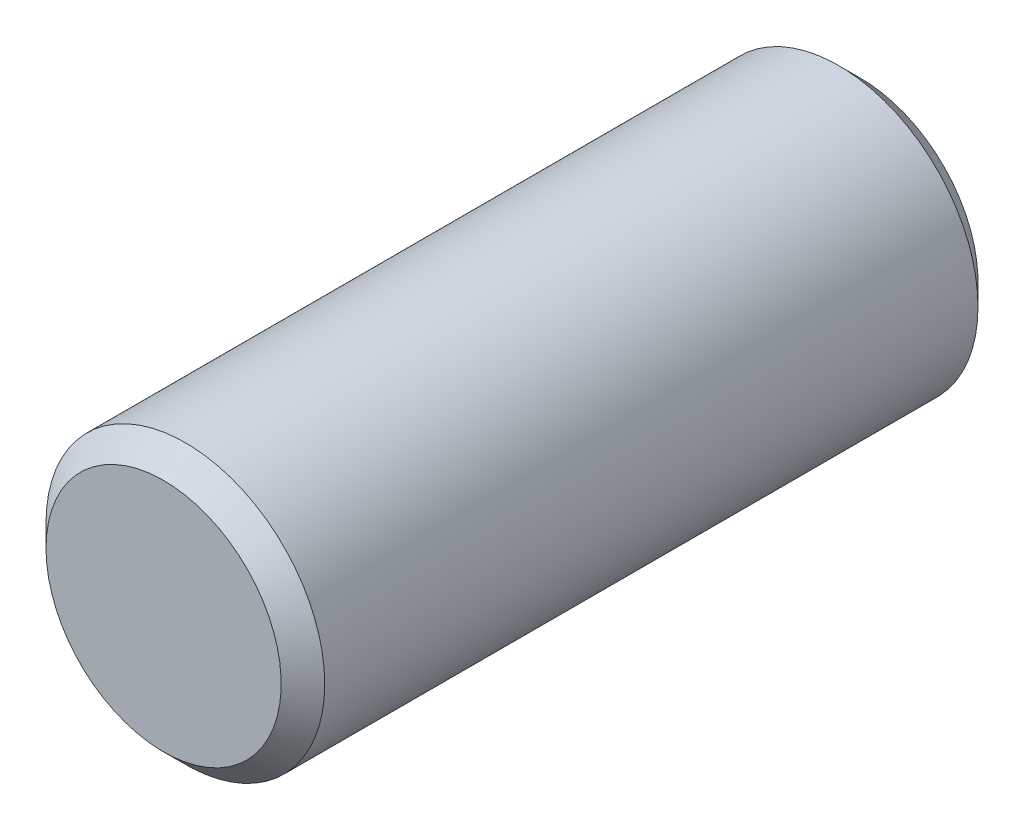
from build123d import *

# Parameters (mm, degrees)
EMPREINTE_DEPTH = 4.5


with BuildPart() as part:
    # E_corps → Corps (revolve)
    with BuildSketch(Plane(origin=(0, 0, 0), x_dir=(1, 0, 0), z_dir=(0, 1, 0)), mode=Mode.PRIVATE) as corps_sk:
        Polygon((0, 0), (3.375, 0), (4, -0.625), (4, -19.375), (3.375, -20), (0, -20), align=None)
    revolve(corps_sk.sketch.rotate(Axis((0, 0, -10), (0, 0, 1)), 180), axis=Axis((0, 0, -10), (0, 0, 1)))

    # E_empreinte → Empreinte (cut)
    with BuildSketch(Plane(origin=(0, 0, 0), x_dir=(-1, 0, 0), z_dir=(0, 0, -1))):
        Polygon((0, 2.29), (-1.983198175, 1.145), (-1.983198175, -1.145), (0, -2.29), (1.983198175, -1.145), (1.983198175, 1.145), align=None)
    extrude(amount=-EMPREINTE_DEPTH, mode=Mode.SUBTRACT)

    # Esquisse3 → Fond_de_l_empreinte section 0
    with BuildSketch(Plane(origin=(0, 0, 4.5), x_dir=(-1, 0, 0), z_dir=(0, 0, -1)), mode=Mode.PRIVATE) as fond_de_l_empreinte_s0:
        with BuildLine():
            Line((1.983198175, 1.145), (0, 2.29))
            Line((0, 2.29), (-1.983198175, 1.145))
            Line((-1.983198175, 1.145), (-1.983198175, -1.145))
            Line((-1.983198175, -1.145), (0, -2.29))
            Line((0, -2.29), (1.983198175, -1.145))
            Line((1.983198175, -1.145), (1.983198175, 1.145))
        make_face()
    loft([Vertex(0, 0, 5), fond_de_l_empreinte_s0.sketch], mode=Mode.SUBTRACT)


solid = part.part
